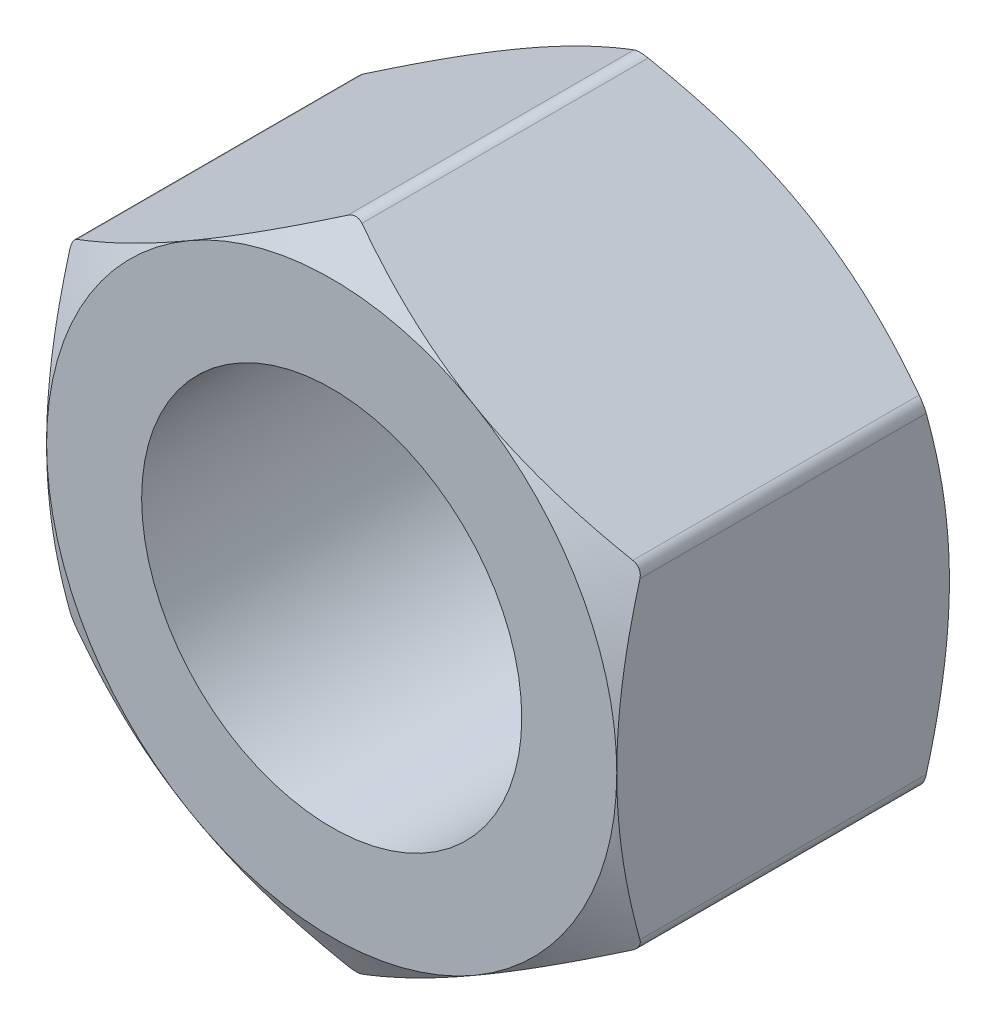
from build123d import *

# Parameters (mm, degrees)
BOSS_EXTRUDE2_DEPTH     = 5.55625
CUT_EXTRUDE4_DEPTH      = 16.574499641
CUT_EXTRUDE4_DEPTH_BACK = 16.574499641
SKETCH16_R              = 6.35
SKETCH7_OUTSIDE_W       = 94.164
SKETCH7_OUTSIDE_H       = 97.112
SKETCH7_OUTSIDE_R       = 9.525
CUT_EXTRUDE5_DEPTH      = 19.307943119
CUT_EXTRUDE5_DRAFT      = -60
MIRROR4_COPY_1_SKETCH_W = 94.164
MIRROR4_COPY_1_SKETCH_H = 97.112
MIRROR4_COPY_1_SKETCH_R = 9.525
MIRROR4_COPY_1_DEPTH    = 19.307943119
MIRROR4_COPY_1_DRAFT    = -60
FILLET2_R               = 0.47625


with BuildPart() as part:
    # Sketch15 → Boss-Extrude2 (new, symmetric)
    with BuildSketch(Plane.XY):
        Polygon((0, 10.998522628), (-9.525, 5.499261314), (-9.525, -5.499261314), (0, -10.998522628), (9.525, -5.499261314), (9.525, 5.499261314), align=None)
    extrude(amount=BOSS_EXTRUDE2_DEPTH, both=True)

    # Sketch16 → Cut-Extrude4 (cut, two sides: drawn at the far end of the back side and taken through both)
    with BuildSketch(Plane.XY.offset(-CUT_EXTRUDE4_DEPTH_BACK)):
        Circle(SKETCH16_R)
    extrude(amount=CUT_EXTRUDE4_DEPTH + CUT_EXTRUDE4_DEPTH_BACK, mode=Mode.SUBTRACT)


with BuildPart() as cut_extrude5_tool:
    # Sketch7 outside → Cut-Extrude5 (with draft: the straight prism first)
    with BuildSketch(Plane.XY.offset(5.55625)):
        Rectangle(SKETCH7_OUTSIDE_W, SKETCH7_OUTSIDE_H)
        Circle(SKETCH7_OUTSIDE_R, mode=Mode.SUBTRACT)
    extrude(amount=-CUT_EXTRUDE5_DEPTH)
    # Cut-Extrude5: the draft: its side faces are tilted about the plane it starts from
    cut_extrude5_sides = [cut_extrude5_tool.faces().sort_by_distance(p)[0] for p in [
        (0, -48.556, -4.09772156),
        (47.082, 0, -4.09772156),
        (0, 48.556, -4.09772156),
        (-47.082, 0, -4.09772156),
        (-9.525, 0, -4.09772156),
    ]]
    draft(cut_extrude5_sides, Plane.XY.offset(5.55625), CUT_EXTRUDE5_DRAFT)


with BuildPart() as part_1:
    add(part.part)

    # Cut-Extrude5: cut by cut_extrude5_tool
    add(cut_extrude5_tool.part, mode=Mode.SUBTRACT)


with BuildPart() as mirror4_copy_1_tool:
    # Mirror4 copy 1 sketch → Mirror4 copy 1 (with draft: the straight prism first)
    with BuildSketch(Plane(origin=(0, 0, -5.55625), x_dir=(1, 0, 0), z_dir=(0, 0, -1))):
        Rectangle(MIRROR4_COPY_1_SKETCH_W, MIRROR4_COPY_1_SKETCH_H)
        Circle(MIRROR4_COPY_1_SKETCH_R, mode=Mode.SUBTRACT)
    extrude(amount=-MIRROR4_COPY_1_DEPTH)
    # Mirror4 copy 1: the draft: its side faces are tilted about the plane it starts from
    mirror4_copy_1_sides = [mirror4_copy_1_tool.faces().sort_by_distance(p)[0] for p in [
        (0, -48.556, 4.09772156),
        (47.082, 0, 4.09772156),
        (0, 48.556, 4.09772156),
        (-47.082, 0, 4.09772156),
        (-9.525, 0, 4.09772156),
    ]]
    draft(mirror4_copy_1_sides, Plane(origin=(0, 0, -5.55625), x_dir=(1, 0, 0), z_dir=(0, 0, -1)), MIRROR4_COPY_1_DRAFT)


with BuildPart() as part_2:
    add(part_1.part)

    # Mirror4 copy 1: cut by mirror4_copy_1_tool
    add(mirror4_copy_1_tool.part, mode=Mode.SUBTRACT)

    # Fillet2
    fillet2_edges = [part_2.edges().sort_by_distance(p)[0] for p in [
        (-9.525, 5.499261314, 0),
        (-9.525, -5.499261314, 0),
        (0, -10.998522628, 0),
        (9.525, -5.499261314, 0),
        (9.525, 5.499261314, 0),
        (0, 10.998522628, 0),
    ]]
    fillet(fillet2_edges, radius=FILLET2_R)


solid = part_2.part
